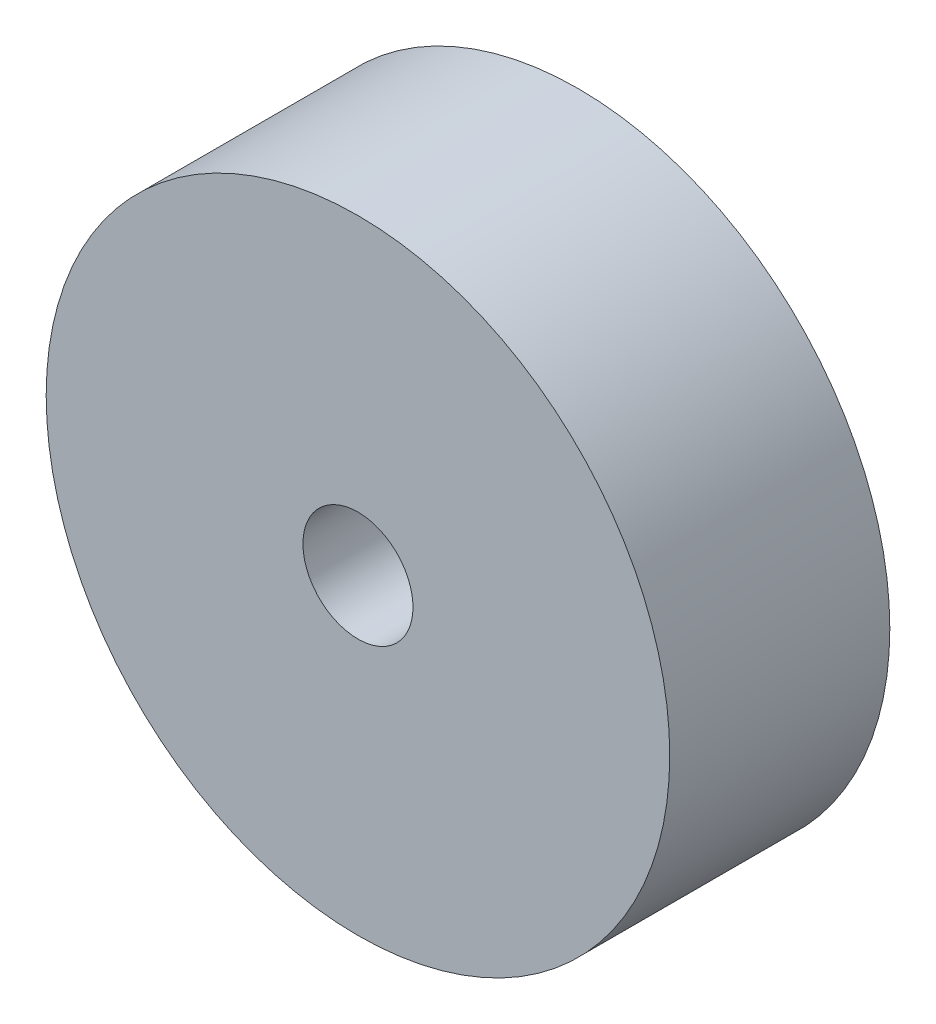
from build123d import *

# Parameters (mm, degrees)
SKETCH_1_R          = 17
EXTRUDE_1_DEPTH     = 12
SKETCH_2_R          = 3
CUT_EXTRUDE_1_DEPTH = 12


with BuildPart() as part:
    # Sketch 1 → Extrude 1 (new body)
    with BuildSketch(Plane.XY):
        Circle(SKETCH_1_R)
    extrude(amount=EXTRUDE_1_DEPTH)

    # Sketch 2 → Cut-Extrude 1 (cut)
    with BuildSketch(Plane(origin=(0, 0, 0), x_dir=(-1, 0, 0), z_dir=(0, 0, -1))):
        Circle(SKETCH_2_R)
    extrude(amount=-CUT_EXTRUDE_1_DEPTH, mode=Mode.SUBTRACT)


solid = part.part
